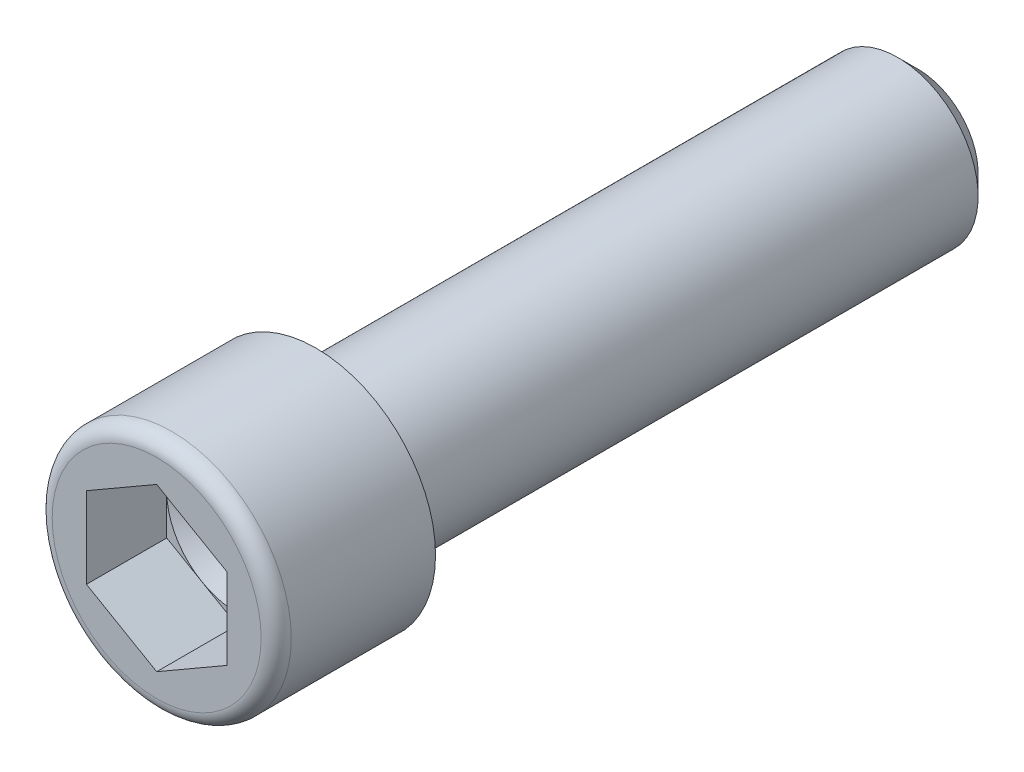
ISO-10303-21;
HEADER;
FILE_DESCRIPTION(('STEP AP214'),'2;1');
FILE_NAME('part.step','',(''),(''),'','','');
FILE_SCHEMA(('AUTOMOTIVE_DESIGN { 1 0 10303 214 1 1 1 1 }'));
ENDSEC;
DATA;
#1=APPLICATION_CONTEXT('core data for automotive mechanical design processes');
#2=APPLICATION_PROTOCOL_DEFINITION('international standard','automotive_design',2000,#1);
#3=PRODUCT_CONTEXT('',#1,'mechanical');
#4=PRODUCT('Part','Part','',(#3));
#5=PRODUCT_RELATED_PRODUCT_CATEGORY('part','',(#4));
#6=PRODUCT_DEFINITION_FORMATION('','',#4);
#7=PRODUCT_DEFINITION_CONTEXT('part definition',#1,'design');
#8=PRODUCT_DEFINITION('design','',#6,#7);
#9=PRODUCT_DEFINITION_SHAPE('','',#8);
#10=(LENGTH_UNIT() NAMED_UNIT(*) SI_UNIT(.MILLI.,.METRE.));
#11=(NAMED_UNIT(*) PLANE_ANGLE_UNIT() SI_UNIT($,.RADIAN.));
#12=(NAMED_UNIT(*) SI_UNIT($,.STERADIAN.) SOLID_ANGLE_UNIT());
#13=UNCERTAINTY_MEASURE_WITH_UNIT(LENGTH_MEASURE(1.E-05),#10,'distance_accuracy_value','');
#14=(GEOMETRIC_REPRESENTATION_CONTEXT(3) GLOBAL_UNCERTAINTY_ASSIGNED_CONTEXT((#13)) GLOBAL_UNIT_ASSIGNED_CONTEXT((#10,
#11,#12)) REPRESENTATION_CONTEXT('',''));
#15=CARTESIAN_POINT('',(0.,0.,0.));
#16=DIRECTION('',(0.,0.,1.));
#17=DIRECTION('',(1.,0.,0.));
#18=AXIS2_PLACEMENT_3D('',#15,#16,#17);
#19=CARTESIAN_POINT('',(-7.,-4.04145188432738,7.88));
#20=DIRECTION('',(0.,0.,-1.));
#21=DIRECTION('',(-1.,0.,0.));
#22=AXIS2_PLACEMENT_3D('',#19,#20,#21);
#23=PLANE('',#22);
#24=CARTESIAN_POINT('',(0.,0.,7.88));
#25=DIRECTION('',(0.,0.,1.));
#26=DIRECTION('',(1.,0.,0.));
#27=AXIS2_PLACEMENT_3D('',#24,#25,#26);
#28=CIRCLE('',#27,7.);
#29=CARTESIAN_POINT('',(7.,0.,7.88));
#30=VERTEX_POINT('',#29);
#31=CARTESIAN_POINT('',(3.5,6.06217782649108,7.88));
#32=VERTEX_POINT('',#31);
#33=EDGE_CURVE('E93',#30,#32,#28,.T.);
#34=ORIENTED_EDGE('',*,*,#33,.F.);
#35=DIRECTION('',(0.,1.,0.));
#36=VECTOR('',#35,1.);
#37=CARTESIAN_POINT('',(7.,-4.04145188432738,7.88));
#38=LINE('',#37,#36);
#39=CARTESIAN_POINT('',(7.,4.04145188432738,7.88));
#40=VERTEX_POINT('',#39);
#41=EDGE_CURVE('E119',#30,#40,#38,.T.);
#42=ORIENTED_EDGE('',*,*,#41,.T.);
#43=DIRECTION('',(-0.866025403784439,0.5,0.));
#44=VECTOR('',#43,1.);
#45=CARTESIAN_POINT('',(7.,4.04145188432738,7.88));
#46=LINE('',#45,#44);
#47=EDGE_CURVE('E115',#40,#32,#46,.T.);
#48=ORIENTED_EDGE('',*,*,#47,.T.);
#49=EDGE_LOOP('',(#34,#42,#48));
#50=FACE_BOUND('',#49,.T.);
#51=ADVANCED_FACE('F14',(#50),#23,.F.);
#52=CARTESIAN_POINT('',(-3.5,6.06217782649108,7.88));
#53=VERTEX_POINT('',#52);
#54=EDGE_CURVE('E95',#32,#53,#28,.T.);
#55=ORIENTED_EDGE('',*,*,#54,.F.);
#56=CARTESIAN_POINT('',(0.,8.08290376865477,7.88));
#57=VERTEX_POINT('',#56);
#58=EDGE_CURVE('E106',#32,#57,#46,.T.);
#59=ORIENTED_EDGE('',*,*,#58,.T.);
#60=DIRECTION('',(-0.866025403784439,-0.5,0.));
#61=VECTOR('',#60,1.);
#62=CARTESIAN_POINT('',(0.,8.08290376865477,7.88));
#63=LINE('',#62,#61);
#64=EDGE_CURVE('E109',#57,#53,#63,.T.);
#65=ORIENTED_EDGE('',*,*,#64,.T.);
#66=EDGE_LOOP('',(#55,#59,#65));
#67=FACE_BOUND('',#66,.T.);
#68=ADVANCED_FACE('F105',(#67),#23,.F.);
#69=CARTESIAN_POINT('',(-7.,0.,7.88));
#70=VERTEX_POINT('',#69);
#71=EDGE_CURVE('E110',#53,#70,#28,.T.);
#72=ORIENTED_EDGE('',*,*,#71,.F.);
#73=CARTESIAN_POINT('',(-7.,4.04145188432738,7.88));
#74=VERTEX_POINT('',#73);
#75=EDGE_CURVE('E121',#53,#74,#63,.T.);
#76=ORIENTED_EDGE('',*,*,#75,.T.);
#77=DIRECTION('',(0.,-1.,0.));
#78=VECTOR('',#77,1.);
#79=CARTESIAN_POINT('',(-7.,4.04145188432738,7.88));
#80=LINE('',#79,#78);
#81=EDGE_CURVE('E127',#74,#70,#80,.T.);
#82=ORIENTED_EDGE('',*,*,#81,.T.);
#83=EDGE_LOOP('',(#72,#76,#82));
#84=FACE_BOUND('',#83,.T.);
#85=ADVANCED_FACE('F173',(#84),#23,.F.);
#86=CARTESIAN_POINT('',(-3.5,-6.06217782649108,7.88));
#87=VERTEX_POINT('',#86);
#88=EDGE_CURVE('E232',#70,#87,#28,.T.);
#89=ORIENTED_EDGE('',*,*,#88,.F.);
#90=CARTESIAN_POINT('',(-7.,-4.04145188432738,7.88));
#91=VERTEX_POINT('',#90);
#92=EDGE_CURVE('E126',#70,#91,#80,.T.);
#93=ORIENTED_EDGE('',*,*,#92,.T.);
#94=DIRECTION('',(0.866025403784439,-0.5,0.));
#95=VECTOR('',#94,1.);
#96=CARTESIAN_POINT('',(-7.,-4.04145188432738,7.88));
#97=LINE('',#96,#95);
#98=EDGE_CURVE('E197',#91,#87,#97,.T.);
#99=ORIENTED_EDGE('',*,*,#98,.T.);
#100=EDGE_LOOP('',(#89,#93,#99));
#101=FACE_BOUND('',#100,.T.);
#102=ADVANCED_FACE('F185',(#101),#23,.F.);
#103=CARTESIAN_POINT('',(3.5,-6.06217782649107,7.88));
#104=VERTEX_POINT('',#103);
#105=EDGE_CURVE('E29',#87,#104,#28,.T.);
#106=ORIENTED_EDGE('',*,*,#105,.F.);
#107=CARTESIAN_POINT('',(0.,-8.08290376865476,7.88));
#108=VERTEX_POINT('',#107);
#109=EDGE_CURVE('E199',#87,#108,#97,.T.);
#110=ORIENTED_EDGE('',*,*,#109,.T.);
#111=DIRECTION('',(0.866025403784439,0.5,0.));
#112=VECTOR('',#111,1.);
#113=CARTESIAN_POINT('',(0.,-8.08290376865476,7.88));
#114=LINE('',#113,#112);
#115=EDGE_CURVE('E196',#108,#104,#114,.T.);
#116=ORIENTED_EDGE('',*,*,#115,.T.);
#117=EDGE_LOOP('',(#106,#110,#116));
#118=FACE_BOUND('',#117,.T.);
#119=ADVANCED_FACE('F176',(#118),#23,.F.);
#120=EDGE_CURVE('E97',#104,#30,#28,.T.);
#121=ORIENTED_EDGE('',*,*,#120,.F.);
#122=CARTESIAN_POINT('',(7.,-4.04145188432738,7.88));
#123=VERTEX_POINT('',#122);
#124=EDGE_CURVE('E189',#104,#123,#114,.T.);
#125=ORIENTED_EDGE('',*,*,#124,.T.);
#126=EDGE_CURVE('E117',#123,#30,#38,.T.);
#127=ORIENTED_EDGE('',*,*,#126,.T.);
#128=EDGE_LOOP('',(#121,#125,#127));
#129=FACE_BOUND('',#128,.T.);
#130=ADVANCED_FACE('F168',(#129),#23,.F.);
#131=CARTESIAN_POINT('',(0.,0.,-60.));
#132=DIRECTION('',(0.,0.,1.));
#133=DIRECTION('',(1.,0.,0.));
#134=AXIS2_PLACEMENT_3D('',#131,#132,#133);
#135=CYLINDRICAL_SURFACE('',#134,8.);
#136=CARTESIAN_POINT('',(0.,0.,-58.));
#137=DIRECTION('',(0.,0.,-1.));
#138=DIRECTION('',(-1.,0.,0.));
#139=AXIS2_PLACEMENT_3D('',#136,#137,#138);
#140=CIRCLE('',#139,8.);
#141=CARTESIAN_POINT('',(-8.,0.,-58.));
#142=VERTEX_POINT('',#141);
#143=EDGE_CURVE('E150',#142,#142,#140,.F.);
#144=ORIENTED_EDGE('',*,*,#143,.T.);
#145=EDGE_LOOP('',(#144));
#146=FACE_BOUND('',#145,.T.);
#147=CARTESIAN_POINT('',(0.,0.,0.));
#148=DIRECTION('',(0.,0.,-1.));
#149=DIRECTION('',(-1.,0.,0.));
#150=AXIS2_PLACEMENT_3D('',#147,#148,#149);
#151=CIRCLE('',#150,8.);
#152=CARTESIAN_POINT('',(-8.,0.,0.));
#153=VERTEX_POINT('',#152);
#154=EDGE_CURVE('E144',#153,#153,#151,.T.);
#155=ORIENTED_EDGE('',*,*,#154,.T.);
#156=EDGE_LOOP('',(#155));
#157=FACE_BOUND('',#156,.T.);
#158=ADVANCED_FACE('F16',(#146,#157),#135,.T.);
#159=CARTESIAN_POINT('',(0.,0.,-60.));
#160=DIRECTION('',(0.,0.,-1.));
#161=DIRECTION('',(-1.,0.,0.));
#162=AXIS2_PLACEMENT_3D('',#159,#160,#161);
#163=PLANE('',#162);
#164=CARTESIAN_POINT('',(0.,0.,-60.));
#165=DIRECTION('',(0.,0.,-1.));
#166=DIRECTION('',(-1.,0.,0.));
#167=AXIS2_PLACEMENT_3D('',#164,#165,#166);
#168=CIRCLE('',#167,6.);
#169=CARTESIAN_POINT('',(-6.,0.,-60.));
#170=VERTEX_POINT('',#169);
#171=EDGE_CURVE('E147',#170,#170,#168,.T.);
#172=ORIENTED_EDGE('',*,*,#171,.T.);
#173=EDGE_LOOP('',(#172));
#174=FACE_BOUND('',#173,.T.);
#175=ADVANCED_FACE('F183',(#174),#163,.T.);
#176=CARTESIAN_POINT('',(0.,0.,-60.));
#177=DIRECTION('',(0.,0.,1.));
#178=DIRECTION('',(1.,0.,0.));
#179=AXIS2_PLACEMENT_3D('',#176,#177,#178);
#180=CONICAL_SURFACE('',#179,6.,0.785398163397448);
#181=ORIENTED_EDGE('',*,*,#143,.F.);
#182=EDGE_LOOP('',(#181));
#183=FACE_BOUND('',#182,.T.);
#184=ORIENTED_EDGE('',*,*,#171,.F.);
#185=EDGE_LOOP('',(#184));
#186=FACE_BOUND('',#185,.T.);
#187=ADVANCED_FACE('F254',(#183,#186),#180,.T.);
#188=CARTESIAN_POINT('',(0.,0.,0.));
#189=DIRECTION('',(0.,0.,-1.));
#190=DIRECTION('',(-1.,0.,0.));
#191=AXIS2_PLACEMENT_3D('',#188,#189,#190);
#192=PLANE('',#191);
#193=CARTESIAN_POINT('',(0.,0.,0.));
#194=DIRECTION('',(0.,0.,-1.));
#195=DIRECTION('',(-1.,0.,0.));
#196=AXIS2_PLACEMENT_3D('',#193,#194,#195);
#197=CIRCLE('',#196,11.915);
#198=CARTESIAN_POINT('',(-11.915,0.,0.));
#199=VERTEX_POINT('',#198);
#200=EDGE_CURVE('E133',#199,#199,#197,.T.);
#201=ORIENTED_EDGE('',*,*,#200,.T.);
#202=EDGE_LOOP('',(#201));
#203=FACE_BOUND('',#202,.T.);
#204=ORIENTED_EDGE('',*,*,#154,.F.);
#205=EDGE_LOOP('',(#204));
#206=FACE_BOUND('',#205,.T.);
#207=ADVANCED_FACE('F252',(#203,#206),#192,.T.);
#208=CARTESIAN_POINT('',(0.,0.,15.88));
#209=DIRECTION('',(0.,0.,-1.));
#210=DIRECTION('',(-1.,0.,0.));
#211=AXIS2_PLACEMENT_3D('',#208,#209,#210);
#212=CYLINDRICAL_SURFACE('',#211,11.915);
#213=CARTESIAN_POINT('',(0.,0.,14.38));
#214=DIRECTION('',(0.,0.,-1.));
#215=DIRECTION('',(-1.,0.,0.));
#216=AXIS2_PLACEMENT_3D('',#213,#214,#215);
#217=CIRCLE('',#216,11.915);
#218=CARTESIAN_POINT('',(-11.915,0.,14.38));
#219=VERTEX_POINT('',#218);
#220=EDGE_CURVE('E22',#219,#219,#217,.T.);
#221=ORIENTED_EDGE('',*,*,#220,.T.);
#222=EDGE_LOOP('',(#221));
#223=FACE_BOUND('',#222,.T.);
#224=ORIENTED_EDGE('',*,*,#200,.F.);
#225=EDGE_LOOP('',(#224));
#226=FACE_BOUND('',#225,.T.);
#227=ADVANCED_FACE('F155',(#223,#226),#212,.T.);
#228=CARTESIAN_POINT('',(0.,0.,15.88));
#229=DIRECTION('',(0.,0.,-1.));
#230=DIRECTION('',(-1.,0.,0.));
#231=AXIS2_PLACEMENT_3D('',#228,#229,#230);
#232=PLANE('',#231);
#233=CARTESIAN_POINT('',(0.,0.,15.88));
#234=DIRECTION('',(0.,0.,-1.));
#235=DIRECTION('',(-1.,0.,0.));
#236=AXIS2_PLACEMENT_3D('',#233,#234,#235);
#237=CIRCLE('',#236,10.415);
#238=CARTESIAN_POINT('',(-10.415,0.,15.88));
#239=VERTEX_POINT('',#238);
#240=EDGE_CURVE('E9',#239,#239,#237,.F.);
#241=ORIENTED_EDGE('',*,*,#240,.T.);
#242=EDGE_LOOP('',(#241));
#243=FACE_BOUND('',#242,.T.);
#244=DIRECTION('',(0.866025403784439,0.5,0.));
#245=VECTOR('',#244,1.);
#246=CARTESIAN_POINT('',(0.,-8.08290376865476,15.88));
#247=LINE('',#246,#245);
#248=CARTESIAN_POINT('',(0.,-8.08290376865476,15.88));
#249=VERTEX_POINT('',#248);
#250=CARTESIAN_POINT('',(7.,-4.04145188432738,15.88));
#251=VERTEX_POINT('',#250);
#252=EDGE_CURVE('E214',#249,#251,#247,.T.);
#253=ORIENTED_EDGE('',*,*,#252,.F.);
#254=DIRECTION('',(0.866025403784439,-0.5,0.));
#255=VECTOR('',#254,1.);
#256=CARTESIAN_POINT('',(-7.,-4.04145188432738,15.88));
#257=LINE('',#256,#255);
#258=CARTESIAN_POINT('',(-7.,-4.04145188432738,15.88));
#259=VERTEX_POINT('',#258);
#260=EDGE_CURVE('E37',#259,#249,#257,.T.);
#261=ORIENTED_EDGE('',*,*,#260,.F.);
#262=DIRECTION('',(0.,-1.,0.));
#263=VECTOR('',#262,1.);
#264=CARTESIAN_POINT('',(-7.,4.04145188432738,15.88));
#265=LINE('',#264,#263);
#266=CARTESIAN_POINT('',(-7.,4.04145188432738,15.88));
#267=VERTEX_POINT('',#266);
#268=EDGE_CURVE('E203',#267,#259,#265,.T.);
#269=ORIENTED_EDGE('',*,*,#268,.F.);
#270=DIRECTION('',(-0.866025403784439,-0.5,0.));
#271=VECTOR('',#270,1.);
#272=CARTESIAN_POINT('',(0.,8.08290376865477,15.88));
#273=LINE('',#272,#271);
#274=CARTESIAN_POINT('',(0.,8.08290376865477,15.88));
#275=VERTEX_POINT('',#274);
#276=EDGE_CURVE('E206',#275,#267,#273,.T.);
#277=ORIENTED_EDGE('',*,*,#276,.F.);
#278=DIRECTION('',(-0.866025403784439,0.5,0.));
#279=VECTOR('',#278,1.);
#280=CARTESIAN_POINT('',(7.,4.04145188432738,15.88));
#281=LINE('',#280,#279);
#282=CARTESIAN_POINT('',(7.,4.04145188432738,15.88));
#283=VERTEX_POINT('',#282);
#284=EDGE_CURVE('E209',#283,#275,#281,.T.);
#285=ORIENTED_EDGE('',*,*,#284,.F.);
#286=DIRECTION('',(0.,1.,0.));
#287=VECTOR('',#286,1.);
#288=CARTESIAN_POINT('',(7.,-4.04145188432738,15.88));
#289=LINE('',#288,#287);
#290=EDGE_CURVE('E211',#251,#283,#289,.T.);
#291=ORIENTED_EDGE('',*,*,#290,.F.);
#292=EDGE_LOOP('',(#253,#261,#269,#277,#285,#291));
#293=FACE_BOUND('',#292,.T.);
#294=ADVANCED_FACE('F220',(#243,#293),#232,.F.);
#295=CARTESIAN_POINT('',(-7.,-4.04145188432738,7.88));
#296=DIRECTION('',(-0.5,-0.866025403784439,0.));
#297=DIRECTION('',(0.866025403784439,-0.5,0.));
#298=AXIS2_PLACEMENT_3D('',#295,#296,#297);
#299=PLANE('',#298);
#300=ORIENTED_EDGE('',*,*,#260,.T.);
#301=DIRECTION('',(0.,0.,1.));
#302=VECTOR('',#301,1.);
#303=CARTESIAN_POINT('',(0.,-8.08290376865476,7.88));
#304=LINE('',#303,#302);
#305=EDGE_CURVE('E130',#108,#249,#304,.T.);
#306=ORIENTED_EDGE('',*,*,#305,.F.);
#307=ORIENTED_EDGE('',*,*,#109,.F.);
#308=ORIENTED_EDGE('',*,*,#98,.F.);
#309=DIRECTION('',(0.,0.,1.));
#310=VECTOR('',#309,1.);
#311=CARTESIAN_POINT('',(-7.,-4.04145188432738,7.88));
#312=LINE('',#311,#310);
#313=EDGE_CURVE('E131',#91,#259,#312,.T.);
#314=ORIENTED_EDGE('',*,*,#313,.T.);
#315=EDGE_LOOP('',(#300,#306,#307,#308,#314));
#316=FACE_BOUND('',#315,.T.);
#317=ADVANCED_FACE('F239',(#316),#299,.F.);
#318=CARTESIAN_POINT('',(-7.,4.04145188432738,7.88));
#319=DIRECTION('',(-1.,0.,0.));
#320=DIRECTION('',(0.,-1.,0.));
#321=AXIS2_PLACEMENT_3D('',#318,#319,#320);
#322=PLANE('',#321);
#323=ORIENTED_EDGE('',*,*,#268,.T.);
#324=ORIENTED_EDGE('',*,*,#313,.F.);
#325=ORIENTED_EDGE('',*,*,#92,.F.);
#326=ORIENTED_EDGE('',*,*,#81,.F.);
#327=DIRECTION('',(0.,0.,1.));
#328=VECTOR('',#327,1.);
#329=CARTESIAN_POINT('',(-7.,4.04145188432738,7.88));
#330=LINE('',#329,#328);
#331=EDGE_CURVE('E134',#74,#267,#330,.T.);
#332=ORIENTED_EDGE('',*,*,#331,.T.);
#333=EDGE_LOOP('',(#323,#324,#325,#326,#332));
#334=FACE_BOUND('',#333,.T.);
#335=ADVANCED_FACE('F238',(#334),#322,.F.);
#336=CARTESIAN_POINT('',(0.,8.08290376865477,7.88));
#337=DIRECTION('',(-0.5,0.866025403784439,0.));
#338=DIRECTION('',(-0.866025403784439,-0.5,0.));
#339=AXIS2_PLACEMENT_3D('',#336,#337,#338);
#340=PLANE('',#339);
#341=ORIENTED_EDGE('',*,*,#276,.T.);
#342=ORIENTED_EDGE('',*,*,#331,.F.);
#343=ORIENTED_EDGE('',*,*,#75,.F.);
#344=ORIENTED_EDGE('',*,*,#64,.F.);
#345=DIRECTION('',(0.,0.,1.));
#346=VECTOR('',#345,1.);
#347=CARTESIAN_POINT('',(0.,8.08290376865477,7.88));
#348=LINE('',#347,#346);
#349=EDGE_CURVE('E116',#57,#275,#348,.T.);
#350=ORIENTED_EDGE('',*,*,#349,.T.);
#351=EDGE_LOOP('',(#341,#342,#343,#344,#350));
#352=FACE_BOUND('',#351,.T.);
#353=ADVANCED_FACE('F227',(#352),#340,.F.);
#354=CARTESIAN_POINT('',(7.,4.04145188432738,7.88));
#355=DIRECTION('',(0.5,0.866025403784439,0.));
#356=DIRECTION('',(-0.866025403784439,0.5,0.));
#357=AXIS2_PLACEMENT_3D('',#354,#355,#356);
#358=PLANE('',#357);
#359=ORIENTED_EDGE('',*,*,#284,.T.);
#360=ORIENTED_EDGE('',*,*,#349,.F.);
#361=ORIENTED_EDGE('',*,*,#58,.F.);
#362=ORIENTED_EDGE('',*,*,#47,.F.);
#363=DIRECTION('',(0.,0.,1.));
#364=VECTOR('',#363,1.);
#365=CARTESIAN_POINT('',(7.,4.04145188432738,7.88));
#366=LINE('',#365,#364);
#367=EDGE_CURVE('E137',#40,#283,#366,.T.);
#368=ORIENTED_EDGE('',*,*,#367,.T.);
#369=EDGE_LOOP('',(#359,#360,#361,#362,#368));
#370=FACE_BOUND('',#369,.T.);
#371=ADVANCED_FACE('F114',(#370),#358,.F.);
#372=CARTESIAN_POINT('',(7.,-4.04145188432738,7.88));
#373=DIRECTION('',(1.,0.,0.));
#374=DIRECTION('',(0.,1.,0.));
#375=AXIS2_PLACEMENT_3D('',#372,#373,#374);
#376=PLANE('',#375);
#377=ORIENTED_EDGE('',*,*,#290,.T.);
#378=ORIENTED_EDGE('',*,*,#367,.F.);
#379=ORIENTED_EDGE('',*,*,#41,.F.);
#380=ORIENTED_EDGE('',*,*,#126,.F.);
#381=DIRECTION('',(0.,0.,1.));
#382=VECTOR('',#381,1.);
#383=CARTESIAN_POINT('',(7.,-4.04145188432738,7.88));
#384=LINE('',#383,#382);
#385=EDGE_CURVE('E139',#123,#251,#384,.T.);
#386=ORIENTED_EDGE('',*,*,#385,.T.);
#387=EDGE_LOOP('',(#377,#378,#379,#380,#386));
#388=FACE_BOUND('',#387,.T.);
#389=ADVANCED_FACE('F223',(#388),#376,.F.);
#390=CARTESIAN_POINT('',(0.,-8.08290376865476,7.88));
#391=DIRECTION('',(0.5,-0.866025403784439,0.));
#392=DIRECTION('',(0.866025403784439,0.5,0.));
#393=AXIS2_PLACEMENT_3D('',#390,#391,#392);
#394=PLANE('',#393);
#395=ORIENTED_EDGE('',*,*,#252,.T.);
#396=ORIENTED_EDGE('',*,*,#385,.F.);
#397=ORIENTED_EDGE('',*,*,#124,.F.);
#398=ORIENTED_EDGE('',*,*,#115,.F.);
#399=ORIENTED_EDGE('',*,*,#305,.T.);
#400=EDGE_LOOP('',(#395,#396,#397,#398,#399));
#401=FACE_BOUND('',#400,.T.);
#402=ADVANCED_FACE('F90',(#401),#394,.F.);
#403=CARTESIAN_POINT('',(0.,0.,7.88));
#404=DIRECTION('',(0.,0.,1.));
#405=DIRECTION('',(1.,0.,0.));
#406=AXIS2_PLACEMENT_3D('',#403,#404,#405);
#407=CONICAL_SURFACE('',#406,7.,1.0471975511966);
#408=CARTESIAN_POINT('',(0.,0.,3.83854811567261));
#409=VERTEX_POINT('',#408);
#410=VERTEX_LOOP('',#409);
#411=FACE_BOUND('',#410,.T.);
#412=ORIENTED_EDGE('',*,*,#33,.T.);
#413=ORIENTED_EDGE('',*,*,#54,.T.);
#414=ORIENTED_EDGE('',*,*,#71,.T.);
#415=ORIENTED_EDGE('',*,*,#88,.T.);
#416=ORIENTED_EDGE('',*,*,#105,.T.);
#417=ORIENTED_EDGE('',*,*,#120,.T.);
#418=EDGE_LOOP('',(#412,#413,#414,#415,#416,#417));
#419=FACE_BOUND('',#418,.T.);
#420=ADVANCED_FACE('F87',(#411,#419),#407,.F.);
#421=CARTESIAN_POINT('',(0.,0.,14.38));
#422=DIRECTION('',(0.,0.,-1.));
#423=DIRECTION('',(-1.,0.,0.));
#424=AXIS2_PLACEMENT_3D('',#421,#422,#423);
#425=TOROIDAL_SURFACE('',#424,10.415,1.5);
#426=ORIENTED_EDGE('',*,*,#240,.F.);
#427=EDGE_LOOP('',(#426));
#428=FACE_BOUND('',#427,.T.);
#429=ORIENTED_EDGE('',*,*,#220,.F.);
#430=EDGE_LOOP('',(#429));
#431=FACE_BOUND('',#430,.T.);
#432=ADVANCED_FACE('F89',(#428,#431),#425,.T.);
#433=CLOSED_SHELL('',(#51,#68,#85,#102,#119,#130,#158,#175,#187,#207,#227,#294,#317,#335,#353,
#371,#389,#402,#420,#432));
#434=MANIFOLD_SOLID_BREP('B1',#433);
#435=ADVANCED_BREP_SHAPE_REPRESENTATION('',(#18,#434),#14);
#436=SHAPE_DEFINITION_REPRESENTATION(#9,#435);
ENDSEC;
END-ISO-10303-21;
